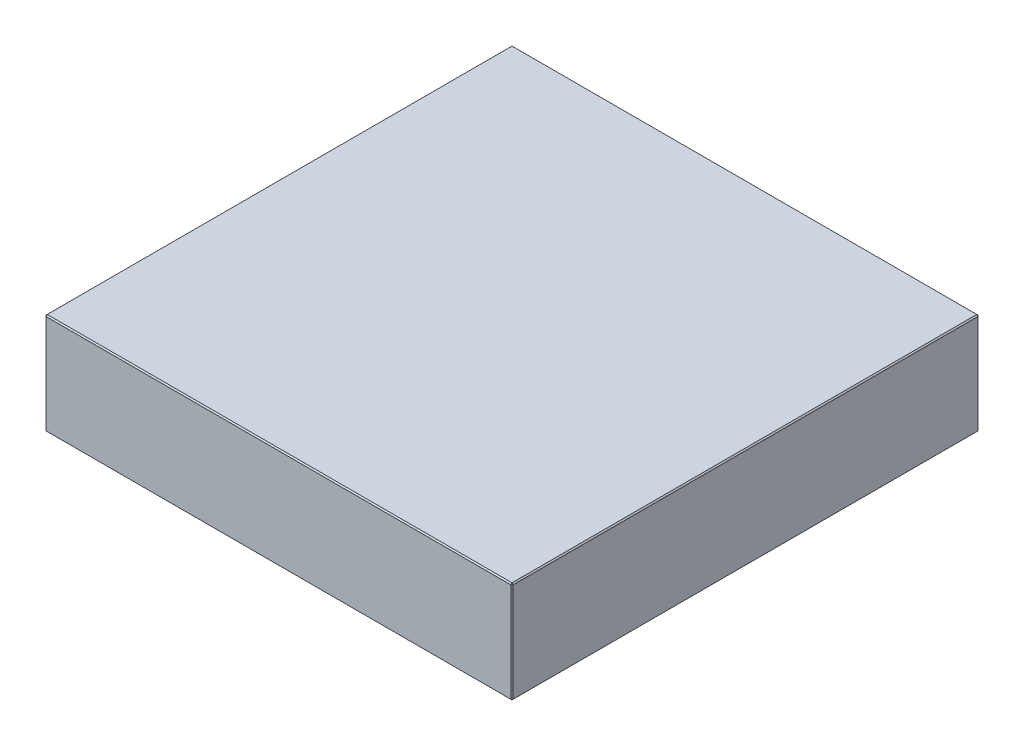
ISO-10303-21;
HEADER;
FILE_DESCRIPTION(('STEP AP214'),'2;1');
FILE_NAME('part.step','',(''),(''),'','','');
FILE_SCHEMA(('AUTOMOTIVE_DESIGN { 1 0 10303 214 1 1 1 1 }'));
ENDSEC;
DATA;
#1=APPLICATION_CONTEXT('core data for automotive mechanical design processes');
#2=APPLICATION_PROTOCOL_DEFINITION('international standard','automotive_design',2000,#1);
#3=PRODUCT_CONTEXT('',#1,'mechanical');
#4=PRODUCT('Part','Part','',(#3));
#5=PRODUCT_RELATED_PRODUCT_CATEGORY('part','',(#4));
#6=PRODUCT_DEFINITION_FORMATION('','',#4);
#7=PRODUCT_DEFINITION_CONTEXT('part definition',#1,'design');
#8=PRODUCT_DEFINITION('design','',#6,#7);
#9=PRODUCT_DEFINITION_SHAPE('','',#8);
#10=(LENGTH_UNIT() NAMED_UNIT(*) SI_UNIT(.MILLI.,.METRE.));
#11=(NAMED_UNIT(*) PLANE_ANGLE_UNIT() SI_UNIT($,.RADIAN.));
#12=(NAMED_UNIT(*) SI_UNIT($,.STERADIAN.) SOLID_ANGLE_UNIT());
#13=UNCERTAINTY_MEASURE_WITH_UNIT(LENGTH_MEASURE(1.E-05),#10,'distance_accuracy_value','');
#14=(GEOMETRIC_REPRESENTATION_CONTEXT(3) GLOBAL_UNCERTAINTY_ASSIGNED_CONTEXT((#13)) GLOBAL_UNIT_ASSIGNED_CONTEXT((#10,
#11,#12)) REPRESENTATION_CONTEXT('',''));
#15=CARTESIAN_POINT('',(0.,0.,0.));
#16=DIRECTION('',(0.,0.,1.));
#17=DIRECTION('',(1.,0.,0.));
#18=AXIS2_PLACEMENT_3D('',#15,#16,#17);
#19=CARTESIAN_POINT('',(-198.,86.,198.));
#20=DIRECTION('',(1.,0.,0.));
#21=DIRECTION('',(0.,0.,-1.));
#22=AXIS2_PLACEMENT_3D('',#19,#20,#21);
#23=PLANE('',#22);
#24=DIRECTION('',(0.,-1.,0.));
#25=VECTOR('',#24,1.);
#26=CARTESIAN_POINT('',(-198.,86.,-197.));
#27=LINE('',#26,#25);
#28=CARTESIAN_POINT('',(-198.,85.,-197.));
#29=VERTEX_POINT('',#28);
#30=CARTESIAN_POINT('',(-198.,1.00000000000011,-197.));
#31=VERTEX_POINT('',#30);
#32=EDGE_CURVE('E114',#29,#31,#27,.T.);
#33=ORIENTED_EDGE('',*,*,#32,.T.);
#34=DIRECTION('',(0.,0.,1.));
#35=VECTOR('',#34,1.);
#36=CARTESIAN_POINT('',(-198.,1.00000000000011,198.));
#37=LINE('',#36,#35);
#38=CARTESIAN_POINT('',(-198.,1.00000000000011,197.));
#39=VERTEX_POINT('',#38);
#40=EDGE_CURVE('E110',#31,#39,#37,.T.);
#41=ORIENTED_EDGE('',*,*,#40,.T.);
#42=DIRECTION('',(0.,1.,0.));
#43=VECTOR('',#42,1.);
#44=CARTESIAN_POINT('',(-198.,86.,197.));
#45=LINE('',#44,#43);
#46=CARTESIAN_POINT('',(-198.,85.,197.));
#47=VERTEX_POINT('',#46);
#48=EDGE_CURVE('E103',#39,#47,#45,.T.);
#49=ORIENTED_EDGE('',*,*,#48,.T.);
#50=DIRECTION('',(0.,0.,-1.));
#51=VECTOR('',#50,1.);
#52=CARTESIAN_POINT('',(-198.,85.,-198.));
#53=LINE('',#52,#51);
#54=EDGE_CURVE('E107',#47,#29,#53,.T.);
#55=ORIENTED_EDGE('',*,*,#54,.T.);
#56=EDGE_LOOP('',(#33,#41,#49,#55));
#57=FACE_BOUND('',#56,.T.);
#58=ADVANCED_FACE('F15',(#57),#23,.F.);
#59=CARTESIAN_POINT('',(198.,86.,198.));
#60=DIRECTION('',(0.,0.,-1.));
#61=DIRECTION('',(-1.,0.,0.));
#62=AXIS2_PLACEMENT_3D('',#59,#60,#61);
#63=PLANE('',#62);
#64=DIRECTION('',(-1.,0.,0.));
#65=VECTOR('',#64,1.);
#66=CARTESIAN_POINT('',(-198.,85.,198.));
#67=LINE('',#66,#65);
#68=CARTESIAN_POINT('',(197.,85.,198.));
#69=VERTEX_POINT('',#68);
#70=CARTESIAN_POINT('',(-197.,85.,198.));
#71=VERTEX_POINT('',#70);
#72=EDGE_CURVE('E164',#69,#71,#67,.T.);
#73=ORIENTED_EDGE('',*,*,#72,.T.);
#74=DIRECTION('',(0.,-1.,0.));
#75=VECTOR('',#74,1.);
#76=CARTESIAN_POINT('',(-197.,86.,198.));
#77=LINE('',#76,#75);
#78=CARTESIAN_POINT('',(-197.,1.00000000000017,198.));
#79=VERTEX_POINT('',#78);
#80=EDGE_CURVE('E122',#71,#79,#77,.T.);
#81=ORIENTED_EDGE('',*,*,#80,.T.);
#82=DIRECTION('',(1.,0.,0.));
#83=VECTOR('',#82,1.);
#84=CARTESIAN_POINT('',(198.,1.00000000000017,198.));
#85=LINE('',#84,#83);
#86=CARTESIAN_POINT('',(197.,1.00000000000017,198.));
#87=VERTEX_POINT('',#86);
#88=EDGE_CURVE('E168',#79,#87,#85,.T.);
#89=ORIENTED_EDGE('',*,*,#88,.T.);
#90=DIRECTION('',(0.,1.,0.));
#91=VECTOR('',#90,1.);
#92=CARTESIAN_POINT('',(197.,86.,198.));
#93=LINE('',#92,#91);
#94=EDGE_CURVE('E166',#87,#69,#93,.T.);
#95=ORIENTED_EDGE('',*,*,#94,.T.);
#96=EDGE_LOOP('',(#73,#81,#89,#95));
#97=FACE_BOUND('',#96,.T.);
#98=ADVANCED_FACE('F275',(#97),#63,.F.);
#99=CARTESIAN_POINT('',(198.,86.,198.));
#100=DIRECTION('',(-1.,0.,0.));
#101=DIRECTION('',(0.,0.,1.));
#102=AXIS2_PLACEMENT_3D('',#99,#100,#101);
#103=PLANE('',#102);
#104=DIRECTION('',(0.,0.,-1.));
#105=VECTOR('',#104,1.);
#106=CARTESIAN_POINT('',(198.,1.00000000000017,198.));
#107=LINE('',#106,#105);
#108=CARTESIAN_POINT('',(198.,1.00000000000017,197.));
#109=VERTEX_POINT('',#108);
#110=CARTESIAN_POINT('',(198.,1.00000000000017,-197.));
#111=VERTEX_POINT('',#110);
#112=EDGE_CURVE('E159',#109,#111,#107,.T.);
#113=ORIENTED_EDGE('',*,*,#112,.T.);
#114=DIRECTION('',(0.,1.,0.));
#115=VECTOR('',#114,1.);
#116=CARTESIAN_POINT('',(198.,86.,-197.));
#117=LINE('',#116,#115);
#118=CARTESIAN_POINT('',(198.,85.,-197.));
#119=VERTEX_POINT('',#118);
#120=EDGE_CURVE('E161',#111,#119,#117,.T.);
#121=ORIENTED_EDGE('',*,*,#120,.T.);
#122=DIRECTION('',(0.,0.,1.));
#123=VECTOR('',#122,1.);
#124=CARTESIAN_POINT('',(198.,85.,198.));
#125=LINE('',#124,#123);
#126=CARTESIAN_POINT('',(198.,85.,197.));
#127=VERTEX_POINT('',#126);
#128=EDGE_CURVE('E155',#119,#127,#125,.T.);
#129=ORIENTED_EDGE('',*,*,#128,.T.);
#130=DIRECTION('',(0.,-1.,0.));
#131=VECTOR('',#130,1.);
#132=CARTESIAN_POINT('',(198.,86.,197.));
#133=LINE('',#132,#131);
#134=EDGE_CURVE('E157',#127,#109,#133,.T.);
#135=ORIENTED_EDGE('',*,*,#134,.T.);
#136=EDGE_LOOP('',(#113,#121,#129,#135));
#137=FACE_BOUND('',#136,.T.);
#138=ADVANCED_FACE('F254',(#137),#103,.F.);
#139=CARTESIAN_POINT('',(198.,86.,-198.));
#140=DIRECTION('',(0.,0.,1.));
#141=DIRECTION('',(1.,0.,0.));
#142=AXIS2_PLACEMENT_3D('',#139,#140,#141);
#143=PLANE('',#142);
#144=DIRECTION('',(0.,-1.,0.));
#145=VECTOR('',#144,1.);
#146=CARTESIAN_POINT('',(197.,86.,-198.));
#147=LINE('',#146,#145);
#148=CARTESIAN_POINT('',(197.,85.,-198.));
#149=VERTEX_POINT('',#148);
#150=CARTESIAN_POINT('',(197.,1.00000000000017,-198.));
#151=VERTEX_POINT('',#150);
#152=EDGE_CURVE('E148',#149,#151,#147,.T.);
#153=ORIENTED_EDGE('',*,*,#152,.T.);
#154=DIRECTION('',(-1.,0.,0.));
#155=VECTOR('',#154,1.);
#156=CARTESIAN_POINT('',(198.,1.00000000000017,-198.));
#157=LINE('',#156,#155);
#158=CARTESIAN_POINT('',(-197.,1.00000000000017,-198.));
#159=VERTEX_POINT('',#158);
#160=EDGE_CURVE('E153',#151,#159,#157,.T.);
#161=ORIENTED_EDGE('',*,*,#160,.T.);
#162=DIRECTION('',(0.,1.,0.));
#163=VECTOR('',#162,1.);
#164=CARTESIAN_POINT('',(-197.,86.,-198.));
#165=LINE('',#164,#163);
#166=CARTESIAN_POINT('',(-197.,85.,-198.));
#167=VERTEX_POINT('',#166);
#168=EDGE_CURVE('E150',#159,#167,#165,.T.);
#169=ORIENTED_EDGE('',*,*,#168,.T.);
#170=DIRECTION('',(1.,0.,0.));
#171=VECTOR('',#170,1.);
#172=CARTESIAN_POINT('',(198.,85.,-198.));
#173=LINE('',#172,#171);
#174=EDGE_CURVE('E146',#167,#149,#173,.T.);
#175=ORIENTED_EDGE('',*,*,#174,.T.);
#176=EDGE_LOOP('',(#153,#161,#169,#175));
#177=FACE_BOUND('',#176,.T.);
#178=ADVANCED_FACE('F284',(#177),#143,.F.);
#179=CARTESIAN_POINT('',(0.,86.,0.));
#180=DIRECTION('',(0.,1.,0.));
#181=DIRECTION('',(0.,0.,1.));
#182=AXIS2_PLACEMENT_3D('',#179,#180,#181);
#183=PLANE('',#182);
#184=DIRECTION('',(0.,0.,-1.));
#185=VECTOR('',#184,1.);
#186=CARTESIAN_POINT('',(197.,86.,-198.));
#187=LINE('',#186,#185);
#188=CARTESIAN_POINT('',(197.,86.,197.));
#189=VERTEX_POINT('',#188);
#190=CARTESIAN_POINT('',(197.,86.,-197.));
#191=VERTEX_POINT('',#190);
#192=EDGE_CURVE('E24',#189,#191,#187,.T.);
#193=ORIENTED_EDGE('',*,*,#192,.T.);
#194=DIRECTION('',(-1.,0.,0.));
#195=VECTOR('',#194,1.);
#196=CARTESIAN_POINT('',(-198.,86.,-197.));
#197=LINE('',#196,#195);
#198=CARTESIAN_POINT('',(-197.,86.,-197.));
#199=VERTEX_POINT('',#198);
#200=EDGE_CURVE('E9',#191,#199,#197,.T.);
#201=ORIENTED_EDGE('',*,*,#200,.T.);
#202=DIRECTION('',(0.,0.,1.));
#203=VECTOR('',#202,1.);
#204=CARTESIAN_POINT('',(-197.,86.,198.));
#205=LINE('',#204,#203);
#206=CARTESIAN_POINT('',(-197.,86.,197.));
#207=VERTEX_POINT('',#206);
#208=EDGE_CURVE('E180',#199,#207,#205,.T.);
#209=ORIENTED_EDGE('',*,*,#208,.T.);
#210=DIRECTION('',(1.,0.,0.));
#211=VECTOR('',#210,1.);
#212=CARTESIAN_POINT('',(198.,86.,197.));
#213=LINE('',#212,#211);
#214=EDGE_CURVE('E35',#207,#189,#213,.T.);
#215=ORIENTED_EDGE('',*,*,#214,.T.);
#216=EDGE_LOOP('',(#193,#201,#209,#215));
#217=FACE_BOUND('',#216,.T.);
#218=ADVANCED_FACE('F350',(#217),#183,.T.);
#219=CARTESIAN_POINT('',(0.,0.,0.));
#220=DIRECTION('',(0.,1.,0.));
#221=DIRECTION('',(0.,0.,1.));
#222=AXIS2_PLACEMENT_3D('',#219,#220,#221);
#223=PLANE('',#222);
#224=DIRECTION('',(0.,0.,1.));
#225=VECTOR('',#224,1.);
#226=CARTESIAN_POINT('',(197.,0.,0.));
#227=LINE('',#226,#225);
#228=CARTESIAN_POINT('',(197.,0.,-197.));
#229=VERTEX_POINT('',#228);
#230=CARTESIAN_POINT('',(197.,0.,197.));
#231=VERTEX_POINT('',#230);
#232=EDGE_CURVE('E171',#229,#231,#227,.T.);
#233=ORIENTED_EDGE('',*,*,#232,.T.);
#234=DIRECTION('',(-1.,0.,0.));
#235=VECTOR('',#234,1.);
#236=CARTESIAN_POINT('',(0.,0.,197.));
#237=LINE('',#236,#235);
#238=CARTESIAN_POINT('',(-197.,0.,197.));
#239=VERTEX_POINT('',#238);
#240=EDGE_CURVE('E177',#231,#239,#237,.T.);
#241=ORIENTED_EDGE('',*,*,#240,.T.);
#242=DIRECTION('',(0.,0.,-1.));
#243=VECTOR('',#242,1.);
#244=CARTESIAN_POINT('',(-197.,0.,0.));
#245=LINE('',#244,#243);
#246=CARTESIAN_POINT('',(-197.,0.,-197.));
#247=VERTEX_POINT('',#246);
#248=EDGE_CURVE('E175',#239,#247,#245,.T.);
#249=ORIENTED_EDGE('',*,*,#248,.T.);
#250=DIRECTION('',(1.,0.,0.));
#251=VECTOR('',#250,1.);
#252=CARTESIAN_POINT('',(0.,0.,-197.));
#253=LINE('',#252,#251);
#254=EDGE_CURVE('E173',#247,#229,#253,.T.);
#255=ORIENTED_EDGE('',*,*,#254,.T.);
#256=EDGE_LOOP('',(#233,#241,#249,#255));
#257=FACE_BOUND('',#256,.T.);
#258=ADVANCED_FACE('F246',(#257),#223,.F.);
#259=CARTESIAN_POINT('',(198.,86.,197.));
#260=DIRECTION('',(-0.707106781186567,0.,-0.707106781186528));
#261=DIRECTION('',(0.,-1.,0.));
#262=AXIS2_PLACEMENT_3D('',#259,#260,#261);
#263=PLANE('',#262);
#264=DIRECTION('',(-0.707106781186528,0.,0.707106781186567));
#265=VECTOR('',#264,1.);
#266=CARTESIAN_POINT('',(197.,85.,198.));
#267=LINE('',#266,#265);
#268=EDGE_CURVE('E19',#69,#127,#267,.F.);
#269=ORIENTED_EDGE('',*,*,#268,.F.);
#270=ORIENTED_EDGE('',*,*,#94,.F.);
#271=DIRECTION('',(0.707106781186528,0.,-0.707106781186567));
#272=VECTOR('',#271,1.);
#273=CARTESIAN_POINT('',(197.,1.00000000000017,198.));
#274=LINE('',#273,#272);
#275=EDGE_CURVE('E142',#109,#87,#274,.F.);
#276=ORIENTED_EDGE('',*,*,#275,.F.);
#277=ORIENTED_EDGE('',*,*,#134,.F.);
#278=EDGE_LOOP('',(#269,#270,#276,#277));
#279=FACE_BOUND('',#278,.T.);
#280=ADVANCED_FACE('F17',(#279),#263,.F.);
#281=CARTESIAN_POINT('',(197.,85.,198.));
#282=DIRECTION('',(0.577350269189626,0.577350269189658,0.577350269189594));
#283=DIRECTION('',(-0.707106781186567,0.707106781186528,0.));
#284=AXIS2_PLACEMENT_3D('',#281,#282,#283);
#285=PLANE('',#284);
#286=DIRECTION('',(0.,-0.707106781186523,0.707106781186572));
#287=VECTOR('',#286,1.);
#288=CARTESIAN_POINT('',(197.,85.,198.));
#289=LINE('',#288,#287);
#290=EDGE_CURVE('E226',#69,#189,#289,.F.);
#291=ORIENTED_EDGE('',*,*,#290,.F.);
#292=ORIENTED_EDGE('',*,*,#268,.T.);
#293=DIRECTION('',(-0.707106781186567,0.707106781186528,0.));
#294=VECTOR('',#293,1.);
#295=CARTESIAN_POINT('',(197.5,85.5,197.));
#296=LINE('',#295,#294);
#297=EDGE_CURVE('E228',#189,#127,#296,.F.);
#298=ORIENTED_EDGE('',*,*,#297,.F.);
#299=EDGE_LOOP('',(#291,#292,#298));
#300=FACE_BOUND('',#299,.T.);
#301=ADVANCED_FACE('F270',(#300),#285,.T.);
#302=CARTESIAN_POINT('',(197.,1.00000000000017,198.));
#303=DIRECTION('',(0.577350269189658,-0.577350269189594,0.577350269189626));
#304=DIRECTION('',(0.707106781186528,0.,-0.707106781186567));
#305=AXIS2_PLACEMENT_3D('',#302,#303,#304);
#306=PLANE('',#305);
#307=DIRECTION('',(-0.707106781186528,-0.707106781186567,0.));
#308=VECTOR('',#307,1.);
#309=CARTESIAN_POINT('',(197.5,0.500000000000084,197.));
#310=LINE('',#309,#308);
#311=EDGE_CURVE('E220',#109,#231,#310,.T.);
#312=ORIENTED_EDGE('',*,*,#311,.F.);
#313=ORIENTED_EDGE('',*,*,#275,.T.);
#314=DIRECTION('',(0.,0.707106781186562,0.707106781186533));
#315=VECTOR('',#314,1.);
#316=CARTESIAN_POINT('',(197.,1.00000000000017,198.));
#317=LINE('',#316,#315);
#318=EDGE_CURVE('E223',#231,#87,#317,.T.);
#319=ORIENTED_EDGE('',*,*,#318,.F.);
#320=EDGE_LOOP('',(#312,#313,#319));
#321=FACE_BOUND('',#320,.T.);
#322=ADVANCED_FACE('F235',(#321),#306,.T.);
#323=CARTESIAN_POINT('',(197.,86.,0.));
#324=DIRECTION('',(0.707106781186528,0.707106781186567,0.));
#325=DIRECTION('',(0.,0.,1.));
#326=AXIS2_PLACEMENT_3D('',#323,#324,#325);
#327=PLANE('',#326);
#328=ORIENTED_EDGE('',*,*,#297,.T.);
#329=ORIENTED_EDGE('',*,*,#128,.F.);
#330=DIRECTION('',(0.707106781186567,-0.707106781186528,0.));
#331=VECTOR('',#330,1.);
#332=CARTESIAN_POINT('',(198.,85.,-197.));
#333=LINE('',#332,#331);
#334=EDGE_CURVE('E215',#191,#119,#333,.T.);
#335=ORIENTED_EDGE('',*,*,#334,.F.);
#336=ORIENTED_EDGE('',*,*,#192,.F.);
#337=EDGE_LOOP('',(#328,#329,#335,#336));
#338=FACE_BOUND('',#337,.T.);
#339=ADVANCED_FACE('F265',(#338),#327,.T.);
#340=CARTESIAN_POINT('',(0.,86.,197.));
#341=DIRECTION('',(0.,0.707106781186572,0.707106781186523));
#342=DIRECTION('',(-1.,0.,0.));
#343=AXIS2_PLACEMENT_3D('',#340,#341,#342);
#344=PLANE('',#343);
#345=ORIENTED_EDGE('',*,*,#290,.T.);
#346=ORIENTED_EDGE('',*,*,#214,.F.);
#347=DIRECTION('',(0.,0.707106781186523,-0.707106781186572));
#348=VECTOR('',#347,1.);
#349=CARTESIAN_POINT('',(-197.,85.5,197.5));
#350=LINE('',#349,#348);
#351=EDGE_CURVE('E126',#71,#207,#350,.T.);
#352=ORIENTED_EDGE('',*,*,#351,.F.);
#353=ORIENTED_EDGE('',*,*,#72,.F.);
#354=EDGE_LOOP('',(#345,#346,#352,#353));
#355=FACE_BOUND('',#354,.T.);
#356=ADVANCED_FACE('F273',(#355),#344,.T.);
#357=CARTESIAN_POINT('',(-197.,86.,198.));
#358=DIRECTION('',(0.707106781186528,0.,-0.707106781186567));
#359=DIRECTION('',(0.,-1.,0.));
#360=AXIS2_PLACEMENT_3D('',#357,#358,#359);
#361=PLANE('',#360);
#362=DIRECTION('',(0.707106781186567,0.,0.707106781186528));
#363=VECTOR('',#362,1.);
#364=CARTESIAN_POINT('',(-197.,1.00000000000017,198.));
#365=LINE('',#364,#363);
#366=EDGE_CURVE('E127',#79,#39,#365,.F.);
#367=ORIENTED_EDGE('',*,*,#366,.F.);
#368=ORIENTED_EDGE('',*,*,#80,.F.);
#369=DIRECTION('',(-0.707106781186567,0.,-0.707106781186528));
#370=VECTOR('',#369,1.);
#371=CARTESIAN_POINT('',(-198.,85.,197.));
#372=LINE('',#371,#370);
#373=EDGE_CURVE('E118',#47,#71,#372,.F.);
#374=ORIENTED_EDGE('',*,*,#373,.F.);
#375=ORIENTED_EDGE('',*,*,#48,.F.);
#376=EDGE_LOOP('',(#367,#368,#374,#375));
#377=FACE_BOUND('',#376,.T.);
#378=ADVANCED_FACE('F120',(#377),#361,.F.);
#379=CARTESIAN_POINT('',(198.,1.00000000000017,198.));
#380=DIRECTION('',(0.,0.707106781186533,-0.707106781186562));
#381=DIRECTION('',(1.,0.,0.));
#382=AXIS2_PLACEMENT_3D('',#379,#380,#381);
#383=PLANE('',#382);
#384=ORIENTED_EDGE('',*,*,#318,.T.);
#385=ORIENTED_EDGE('',*,*,#88,.F.);
#386=DIRECTION('',(0.,-0.707106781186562,-0.707106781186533));
#387=VECTOR('',#386,1.);
#388=CARTESIAN_POINT('',(-197.,1.00000000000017,198.));
#389=LINE('',#388,#387);
#390=EDGE_CURVE('E211',#239,#79,#389,.F.);
#391=ORIENTED_EDGE('',*,*,#390,.F.);
#392=ORIENTED_EDGE('',*,*,#240,.F.);
#393=EDGE_LOOP('',(#384,#385,#391,#392));
#394=FACE_BOUND('',#393,.T.);
#395=ADVANCED_FACE('F243',(#394),#383,.F.);
#396=CARTESIAN_POINT('',(198.,1.00000000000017,198.));
#397=DIRECTION('',(-0.707106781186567,0.707106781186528,0.));
#398=DIRECTION('',(0.,0.,-1.));
#399=AXIS2_PLACEMENT_3D('',#396,#397,#398);
#400=PLANE('',#399);
#401=ORIENTED_EDGE('',*,*,#311,.T.);
#402=ORIENTED_EDGE('',*,*,#232,.F.);
#403=DIRECTION('',(0.707106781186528,0.707106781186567,0.));
#404=VECTOR('',#403,1.);
#405=CARTESIAN_POINT('',(197.5,0.50000000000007,-197.));
#406=LINE('',#405,#404);
#407=EDGE_CURVE('E208',#111,#229,#406,.F.);
#408=ORIENTED_EDGE('',*,*,#407,.F.);
#409=ORIENTED_EDGE('',*,*,#112,.F.);
#410=EDGE_LOOP('',(#401,#402,#408,#409));
#411=FACE_BOUND('',#410,.T.);
#412=ADVANCED_FACE('F251',(#411),#400,.F.);
#413=CARTESIAN_POINT('',(197.,86.,-198.));
#414=DIRECTION('',(-0.707106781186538,0.,0.707106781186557));
#415=DIRECTION('',(0.,-1.,0.));
#416=AXIS2_PLACEMENT_3D('',#413,#414,#415);
#417=PLANE('',#416);
#418=DIRECTION('',(0.707106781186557,0.,0.707106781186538));
#419=VECTOR('',#418,1.);
#420=CARTESIAN_POINT('',(198.,85.,-197.));
#421=LINE('',#420,#419);
#422=EDGE_CURVE('E217',#119,#149,#421,.F.);
#423=ORIENTED_EDGE('',*,*,#422,.F.);
#424=ORIENTED_EDGE('',*,*,#120,.F.);
#425=DIRECTION('',(-0.707106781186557,0.,-0.707106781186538));
#426=VECTOR('',#425,1.);
#427=CARTESIAN_POINT('',(197.,1.00000000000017,-198.));
#428=LINE('',#427,#426);
#429=EDGE_CURVE('E205',#151,#111,#428,.F.);
#430=ORIENTED_EDGE('',*,*,#429,.F.);
#431=ORIENTED_EDGE('',*,*,#152,.F.);
#432=EDGE_LOOP('',(#423,#424,#430,#431));
#433=FACE_BOUND('',#432,.T.);
#434=ADVANCED_FACE('F258',(#433),#417,.F.);
#435=CARTESIAN_POINT('',(198.,85.,-197.));
#436=DIRECTION('',(0.577350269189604,0.577350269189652,-0.57735026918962));
#437=DIRECTION('',(0.,0.707106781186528,0.707106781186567));
#438=AXIS2_PLACEMENT_3D('',#435,#436,#437);
#439=PLANE('',#438);
#440=ORIENTED_EDGE('',*,*,#334,.T.);
#441=ORIENTED_EDGE('',*,*,#422,.T.);
#442=DIRECTION('',(0.,0.707106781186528,0.707106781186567));
#443=VECTOR('',#442,1.);
#444=CARTESIAN_POINT('',(197.,85.5,-197.5));
#445=LINE('',#444,#443);
#446=EDGE_CURVE('E134',#191,#149,#445,.F.);
#447=ORIENTED_EDGE('',*,*,#446,.F.);
#448=EDGE_LOOP('',(#440,#441,#447));
#449=FACE_BOUND('',#448,.T.);
#450=ADVANCED_FACE('F325',(#449),#439,.T.);
#451=CARTESIAN_POINT('',(-198.,85.,197.));
#452=DIRECTION('',(-0.577350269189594,0.577350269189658,0.577350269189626));
#453=DIRECTION('',(0.,-0.707106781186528,0.707106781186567));
#454=AXIS2_PLACEMENT_3D('',#451,#452,#453);
#455=PLANE('',#454);
#456=ORIENTED_EDGE('',*,*,#373,.T.);
#457=ORIENTED_EDGE('',*,*,#351,.T.);
#458=DIRECTION('',(-0.707106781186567,-0.707106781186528,0.));
#459=VECTOR('',#458,1.);
#460=CARTESIAN_POINT('',(-198.,85.,197.));
#461=LINE('',#460,#459);
#462=EDGE_CURVE('E130',#47,#207,#461,.F.);
#463=ORIENTED_EDGE('',*,*,#462,.F.);
#464=EDGE_LOOP('',(#456,#457,#463));
#465=FACE_BOUND('',#464,.T.);
#466=ADVANCED_FACE('F131',(#465),#455,.T.);
#467=CARTESIAN_POINT('',(-197.,1.00000000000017,198.));
#468=DIRECTION('',(-0.577350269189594,-0.577350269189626,0.577350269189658));
#469=DIRECTION('',(0.,-0.707106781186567,-0.707106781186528));
#470=AXIS2_PLACEMENT_3D('',#467,#468,#469);
#471=PLANE('',#470);
#472=ORIENTED_EDGE('',*,*,#390,.T.);
#473=ORIENTED_EDGE('',*,*,#366,.T.);
#474=DIRECTION('',(-0.707106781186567,0.707106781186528,0.));
#475=VECTOR('',#474,1.);
#476=CARTESIAN_POINT('',(-197.5,0.500000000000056,197.));
#477=LINE('',#476,#475);
#478=EDGE_CURVE('E135',#239,#39,#477,.T.);
#479=ORIENTED_EDGE('',*,*,#478,.F.);
#480=EDGE_LOOP('',(#472,#473,#479));
#481=FACE_BOUND('',#480,.T.);
#482=ADVANCED_FACE('F318',(#481),#471,.T.);
#483=CARTESIAN_POINT('',(197.,1.00000000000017,-198.));
#484=DIRECTION('',(0.577350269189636,-0.577350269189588,-0.577350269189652));
#485=DIRECTION('',(-0.707106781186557,0.,-0.707106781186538));
#486=AXIS2_PLACEMENT_3D('',#483,#484,#485);
#487=PLANE('',#486);
#488=ORIENTED_EDGE('',*,*,#429,.T.);
#489=ORIENTED_EDGE('',*,*,#407,.T.);
#490=DIRECTION('',(0.,-0.707106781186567,0.707106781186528));
#491=VECTOR('',#490,1.);
#492=CARTESIAN_POINT('',(197.,1.00000000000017,-198.));
#493=LINE('',#492,#491);
#494=EDGE_CURVE('E198',#151,#229,#493,.T.);
#495=ORIENTED_EDGE('',*,*,#494,.F.);
#496=EDGE_LOOP('',(#488,#489,#495));
#497=FACE_BOUND('',#496,.T.);
#498=ADVANCED_FACE('F314',(#497),#487,.T.);
#499=CARTESIAN_POINT('',(0.,86.,-197.));
#500=DIRECTION('',(0.,0.707106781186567,-0.707106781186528));
#501=DIRECTION('',(1.,0.,0.));
#502=AXIS2_PLACEMENT_3D('',#499,#500,#501);
#503=PLANE('',#502);
#504=ORIENTED_EDGE('',*,*,#446,.T.);
#505=ORIENTED_EDGE('',*,*,#174,.F.);
#506=DIRECTION('',(0.,-0.707106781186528,-0.707106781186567));
#507=VECTOR('',#506,1.);
#508=CARTESIAN_POINT('',(-197.,85.,-198.));
#509=LINE('',#508,#507);
#510=EDGE_CURVE('E195',#199,#167,#509,.T.);
#511=ORIENTED_EDGE('',*,*,#510,.F.);
#512=ORIENTED_EDGE('',*,*,#200,.F.);
#513=EDGE_LOOP('',(#504,#505,#511,#512));
#514=FACE_BOUND('',#513,.T.);
#515=ADVANCED_FACE('F311',(#514),#503,.T.);
#516=CARTESIAN_POINT('',(-197.,86.,0.));
#517=DIRECTION('',(-0.707106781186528,0.707106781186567,0.));
#518=DIRECTION('',(0.,0.,-1.));
#519=AXIS2_PLACEMENT_3D('',#516,#517,#518);
#520=PLANE('',#519);
#521=ORIENTED_EDGE('',*,*,#462,.T.);
#522=ORIENTED_EDGE('',*,*,#208,.F.);
#523=DIRECTION('',(0.707106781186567,0.707106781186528,0.));
#524=VECTOR('',#523,1.);
#525=CARTESIAN_POINT('',(-197.5,85.5,-197.));
#526=LINE('',#525,#524);
#527=EDGE_CURVE('E138',#29,#199,#526,.T.);
#528=ORIENTED_EDGE('',*,*,#527,.F.);
#529=ORIENTED_EDGE('',*,*,#54,.F.);
#530=EDGE_LOOP('',(#521,#522,#528,#529));
#531=FACE_BOUND('',#530,.T.);
#532=ADVANCED_FACE('F137',(#531),#520,.T.);
#533=CARTESIAN_POINT('',(-198.,1.00000000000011,198.));
#534=DIRECTION('',(0.707106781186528,0.707106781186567,0.));
#535=DIRECTION('',(0.,0.,1.));
#536=AXIS2_PLACEMENT_3D('',#533,#534,#535);
#537=PLANE('',#536);
#538=ORIENTED_EDGE('',*,*,#478,.T.);
#539=ORIENTED_EDGE('',*,*,#40,.F.);
#540=DIRECTION('',(0.707106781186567,-0.707106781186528,0.));
#541=VECTOR('',#540,1.);
#542=CARTESIAN_POINT('',(-198.,1.00000000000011,-197.));
#543=LINE('',#542,#541);
#544=EDGE_CURVE('E191',#247,#31,#543,.F.);
#545=ORIENTED_EDGE('',*,*,#544,.F.);
#546=ORIENTED_EDGE('',*,*,#248,.F.);
#547=EDGE_LOOP('',(#538,#539,#545,#546));
#548=FACE_BOUND('',#547,.T.);
#549=ADVANCED_FACE('F304',(#548),#537,.F.);
#550=CARTESIAN_POINT('',(198.,1.00000000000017,-198.));
#551=DIRECTION('',(0.,0.707106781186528,0.707106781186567));
#552=DIRECTION('',(-1.,0.,0.));
#553=AXIS2_PLACEMENT_3D('',#550,#551,#552);
#554=PLANE('',#553);
#555=ORIENTED_EDGE('',*,*,#494,.T.);
#556=ORIENTED_EDGE('',*,*,#254,.F.);
#557=DIRECTION('',(0.,0.707106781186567,-0.707106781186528));
#558=VECTOR('',#557,1.);
#559=CARTESIAN_POINT('',(-197.,0.500000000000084,-197.5));
#560=LINE('',#559,#558);
#561=EDGE_CURVE('E188',#159,#247,#560,.F.);
#562=ORIENTED_EDGE('',*,*,#561,.F.);
#563=ORIENTED_EDGE('',*,*,#160,.F.);
#564=EDGE_LOOP('',(#555,#556,#562,#563));
#565=FACE_BOUND('',#564,.T.);
#566=ADVANCED_FACE('F300',(#565),#554,.F.);
#567=CARTESIAN_POINT('',(-197.,85.,-198.));
#568=DIRECTION('',(-0.577350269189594,0.577350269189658,-0.577350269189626));
#569=DIRECTION('',(0.,0.707106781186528,0.707106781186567));
#570=AXIS2_PLACEMENT_3D('',#567,#568,#569);
#571=PLANE('',#570);
#572=ORIENTED_EDGE('',*,*,#527,.T.);
#573=ORIENTED_EDGE('',*,*,#510,.T.);
#574=DIRECTION('',(0.707106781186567,0.,-0.707106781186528));
#575=VECTOR('',#574,1.);
#576=CARTESIAN_POINT('',(-197.,85.,-198.));
#577=LINE('',#576,#575);
#578=EDGE_CURVE('E186',#29,#167,#577,.T.);
#579=ORIENTED_EDGE('',*,*,#578,.F.);
#580=EDGE_LOOP('',(#572,#573,#579));
#581=FACE_BOUND('',#580,.T.);
#582=ADVANCED_FACE('F296',(#581),#571,.T.);
#583=CARTESIAN_POINT('',(-198.,1.00000000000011,-197.));
#584=DIRECTION('',(-0.577350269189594,-0.577350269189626,-0.577350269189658));
#585=DIRECTION('',(0.,0.707106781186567,-0.707106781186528));
#586=AXIS2_PLACEMENT_3D('',#583,#584,#585);
#587=PLANE('',#586);
#588=ORIENTED_EDGE('',*,*,#561,.T.);
#589=ORIENTED_EDGE('',*,*,#544,.T.);
#590=DIRECTION('',(-0.707106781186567,0.,0.707106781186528));
#591=VECTOR('',#590,1.);
#592=CARTESIAN_POINT('',(-198.,1.00000000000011,-197.));
#593=LINE('',#592,#591);
#594=EDGE_CURVE('E184',#159,#31,#593,.T.);
#595=ORIENTED_EDGE('',*,*,#594,.F.);
#596=EDGE_LOOP('',(#588,#589,#595));
#597=FACE_BOUND('',#596,.T.);
#598=ADVANCED_FACE('F292',(#597),#587,.T.);
#599=CARTESIAN_POINT('',(-198.,86.,-197.));
#600=DIRECTION('',(0.707106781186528,0.,0.707106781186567));
#601=DIRECTION('',(0.,-1.,0.));
#602=AXIS2_PLACEMENT_3D('',#599,#600,#601);
#603=PLANE('',#602);
#604=ORIENTED_EDGE('',*,*,#578,.T.);
#605=ORIENTED_EDGE('',*,*,#168,.F.);
#606=ORIENTED_EDGE('',*,*,#594,.T.);
#607=ORIENTED_EDGE('',*,*,#32,.F.);
#608=EDGE_LOOP('',(#604,#605,#606,#607));
#609=FACE_BOUND('',#608,.T.);
#610=ADVANCED_FACE('F289',(#609),#603,.F.);
#611=CLOSED_SHELL('',(#58,#98,#138,#178,#218,#258,#280,#301,#322,#339,#356,#378,#395,#412,#434,
#450,#466,#482,#498,#515,#532,#549,#566,#582,#598,#610));
#612=MANIFOLD_SOLID_BREP('B1',#611);
#613=ADVANCED_BREP_SHAPE_REPRESENTATION('',(#18,#612),#14);
#614=SHAPE_DEFINITION_REPRESENTATION(#9,#613);
ENDSEC;
END-ISO-10303-21;
